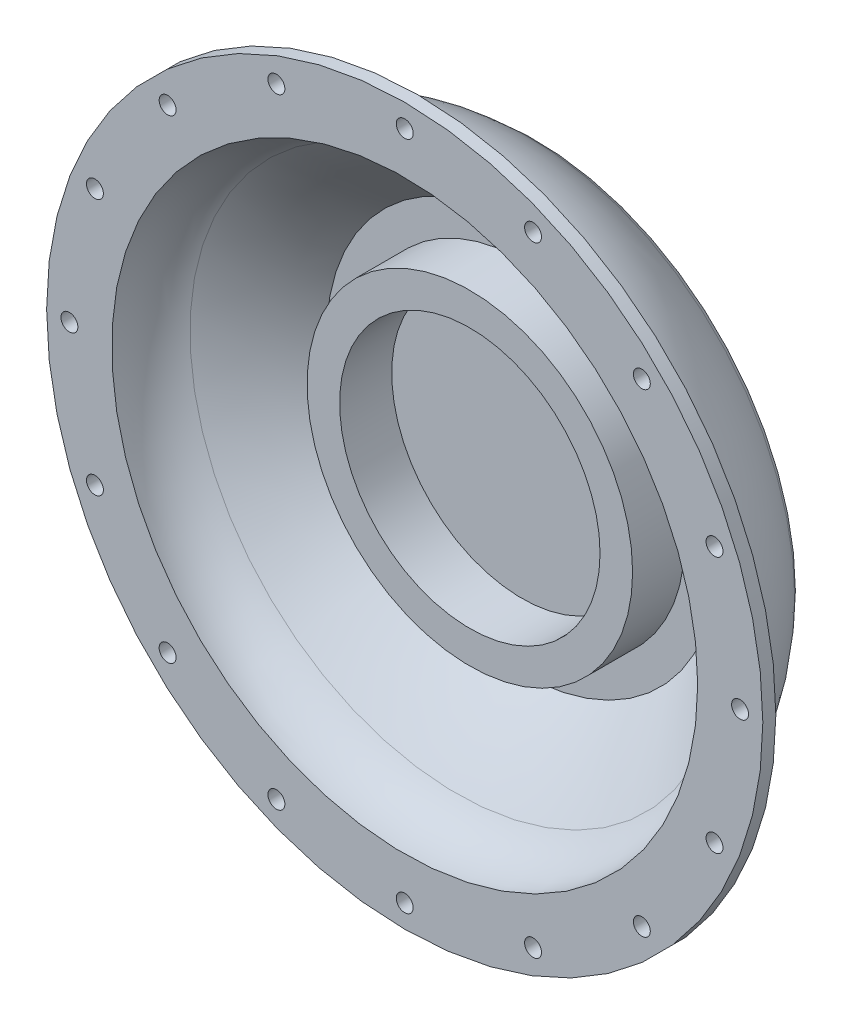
ISO-10303-21;
HEADER;
FILE_DESCRIPTION(('STEP AP214'),'2;1');
FILE_NAME('part.step','',(''),(''),'','','');
FILE_SCHEMA(('AUTOMOTIVE_DESIGN { 1 0 10303 214 1 1 1 1 }'));
ENDSEC;
DATA;
#1=APPLICATION_CONTEXT('core data for automotive mechanical design processes');
#2=APPLICATION_PROTOCOL_DEFINITION('international standard','automotive_design',2000,#1);
#3=PRODUCT_CONTEXT('',#1,'mechanical');
#4=PRODUCT('Part','Part','',(#3));
#5=PRODUCT_RELATED_PRODUCT_CATEGORY('part','',(#4));
#6=PRODUCT_DEFINITION_FORMATION('','',#4);
#7=PRODUCT_DEFINITION_CONTEXT('part definition',#1,'design');
#8=PRODUCT_DEFINITION('design','',#6,#7);
#9=PRODUCT_DEFINITION_SHAPE('','',#8);
#10=(LENGTH_UNIT() NAMED_UNIT(*) SI_UNIT(.MILLI.,.METRE.));
#11=(NAMED_UNIT(*) PLANE_ANGLE_UNIT() SI_UNIT($,.RADIAN.));
#12=(NAMED_UNIT(*) SI_UNIT($,.STERADIAN.) SOLID_ANGLE_UNIT());
#13=UNCERTAINTY_MEASURE_WITH_UNIT(LENGTH_MEASURE(1.E-05),#10,'distance_accuracy_value','');
#14=(GEOMETRIC_REPRESENTATION_CONTEXT(3) GLOBAL_UNCERTAINTY_ASSIGNED_CONTEXT((#13)) GLOBAL_UNIT_ASSIGNED_CONTEXT((#10,
#11,#12)) REPRESENTATION_CONTEXT('',''));
#15=CARTESIAN_POINT('',(0.,0.,0.));
#16=DIRECTION('',(0.,0.,1.));
#17=DIRECTION('',(1.,0.,0.));
#18=AXIS2_PLACEMENT_3D('',#15,#16,#17);
#19=CARTESIAN_POINT('',(0.,47.5610145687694,-2.));
#20=DIRECTION('',(0.,0.,1.));
#21=DIRECTION('',(1.,0.,0.));
#22=AXIS2_PLACEMENT_3D('',#19,#20,#21);
#23=PLANE('',#22);
#24=CARTESIAN_POINT('',(36.4159992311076,-36.4159992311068,-2.));
#25=DIRECTION('',(0.,0.,-1.));
#26=DIRECTION('',(-1.,0.,0.));
#27=AXIS2_PLACEMENT_3D('',#24,#25,#26);
#28=CIRCLE('',#27,1.3);
#29=CARTESIAN_POINT('',(35.1159992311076,-36.4159992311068,-2.));
#30=VERTEX_POINT('',#29);
#31=EDGE_CURVE('E164',#30,#30,#28,.T.);
#32=ORIENTED_EDGE('',*,*,#31,.F.);
#33=EDGE_LOOP('',(#32));
#34=FACE_BOUND('',#33,.T.);
#35=CARTESIAN_POINT('',(5.39433866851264E-13,-51.5,-2.));
#36=DIRECTION('',(0.,0.,-1.));
#37=DIRECTION('',(-1.,0.,0.));
#38=AXIS2_PLACEMENT_3D('',#35,#36,#37);
#39=CIRCLE('',#38,1.3);
#40=CARTESIAN_POINT('',(-1.29999999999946,-51.5,-2.));
#41=VERTEX_POINT('',#40);
#42=EDGE_CURVE('E152',#41,#41,#39,.T.);
#43=ORIENTED_EDGE('',*,*,#42,.F.);
#44=EDGE_LOOP('',(#43));
#45=FACE_BOUND('',#44,.T.);
#46=CARTESIAN_POINT('',(-36.4159992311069,-36.4159992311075,-2.));
#47=DIRECTION('',(0.,0.,-1.));
#48=DIRECTION('',(-1.,0.,0.));
#49=AXIS2_PLACEMENT_3D('',#46,#47,#48);
#50=CIRCLE('',#49,1.3);
#51=CARTESIAN_POINT('',(-37.7159992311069,-36.4159992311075,-2.));
#52=VERTEX_POINT('',#51);
#53=EDGE_CURVE('E140',#52,#52,#50,.T.);
#54=ORIENTED_EDGE('',*,*,#53,.F.);
#55=EDGE_LOOP('',(#54));
#56=FACE_BOUND('',#55,.T.);
#57=CARTESIAN_POINT('',(-47.5797959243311,-19.7081967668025,-2.));
#58=DIRECTION('',(0.,0.,-1.));
#59=DIRECTION('',(-1.,0.,0.));
#60=AXIS2_PLACEMENT_3D('',#57,#58,#59);
#61=CIRCLE('',#60,1.3);
#62=CARTESIAN_POINT('',(-48.8797959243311,-19.7081967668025,-2.));
#63=VERTEX_POINT('',#62);
#64=EDGE_CURVE('E134',#63,#63,#61,.T.);
#65=ORIENTED_EDGE('',*,*,#64,.F.);
#66=EDGE_LOOP('',(#65));
#67=FACE_BOUND('',#66,.T.);
#68=CARTESIAN_POINT('',(-51.5,0.,-2.));
#69=DIRECTION('',(0.,0.,-1.));
#70=DIRECTION('',(-1.,0.,0.));
#71=AXIS2_PLACEMENT_3D('',#68,#69,#70);
#72=CIRCLE('',#71,1.3);
#73=CARTESIAN_POINT('',(-52.8,0.,-2.));
#74=VERTEX_POINT('',#73);
#75=EDGE_CURVE('E128',#74,#74,#72,.T.);
#76=ORIENTED_EDGE('',*,*,#75,.F.);
#77=EDGE_LOOP('',(#76));
#78=FACE_BOUND('',#77,.T.);
#79=CARTESIAN_POINT('',(-36.4159992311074,36.415999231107,-2.));
#80=DIRECTION('',(0.,0.,-1.));
#81=DIRECTION('',(-1.,0.,0.));
#82=AXIS2_PLACEMENT_3D('',#79,#80,#81);
#83=CIRCLE('',#82,1.3);
#84=CARTESIAN_POINT('',(-37.7159992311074,36.415999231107,-2.));
#85=VERTEX_POINT('',#84);
#86=EDGE_CURVE('E116',#85,#85,#83,.T.);
#87=ORIENTED_EDGE('',*,*,#86,.F.);
#88=EDGE_LOOP('',(#87));
#89=FACE_BOUND('',#88,.T.);
#90=CARTESIAN_POINT('',(-19.7081967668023,47.5797959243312,-2.));
#91=DIRECTION('',(0.,0.,-1.));
#92=DIRECTION('',(-1.,0.,0.));
#93=AXIS2_PLACEMENT_3D('',#90,#91,#92);
#94=CIRCLE('',#93,1.3);
#95=CARTESIAN_POINT('',(-21.0081967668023,47.5797959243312,-2.));
#96=VERTEX_POINT('',#95);
#97=EDGE_CURVE('E110',#96,#96,#94,.T.);
#98=ORIENTED_EDGE('',*,*,#97,.F.);
#99=EDGE_LOOP('',(#98));
#100=FACE_BOUND('',#99,.T.);
#101=CARTESIAN_POINT('',(-1.79811288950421E-13,51.5,-2.));
#102=DIRECTION('',(0.,0.,-1.));
#103=DIRECTION('',(-1.,0.,0.));
#104=AXIS2_PLACEMENT_3D('',#101,#102,#103);
#105=CIRCLE('',#104,1.3);
#106=CARTESIAN_POINT('',(-1.30000000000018,51.5,-2.));
#107=VERTEX_POINT('',#106);
#108=EDGE_CURVE('E104',#107,#107,#105,.T.);
#109=ORIENTED_EDGE('',*,*,#108,.F.);
#110=EDGE_LOOP('',(#109));
#111=FACE_BOUND('',#110,.T.);
#112=CARTESIAN_POINT('',(19.708196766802,47.5797959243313,-2.));
#113=DIRECTION('',(0.,0.,-1.));
#114=DIRECTION('',(-1.,0.,0.));
#115=AXIS2_PLACEMENT_3D('',#112,#113,#114);
#116=CIRCLE('',#115,1.3);
#117=CARTESIAN_POINT('',(18.408196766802,47.5797959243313,-2.));
#118=VERTEX_POINT('',#117);
#119=EDGE_CURVE('E98',#118,#118,#116,.T.);
#120=ORIENTED_EDGE('',*,*,#119,.F.);
#121=EDGE_LOOP('',(#120));
#122=FACE_BOUND('',#121,.T.);
#123=CARTESIAN_POINT('',(36.4159992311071,36.4159992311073,-2.));
#124=DIRECTION('',(0.,0.,-1.));
#125=DIRECTION('',(-1.,0.,0.));
#126=AXIS2_PLACEMENT_3D('',#123,#124,#125);
#127=CIRCLE('',#126,1.3);
#128=CARTESIAN_POINT('',(35.1159992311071,36.4159992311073,-2.));
#129=VERTEX_POINT('',#128);
#130=EDGE_CURVE('E92',#129,#129,#127,.T.);
#131=ORIENTED_EDGE('',*,*,#130,.F.);
#132=EDGE_LOOP('',(#131));
#133=FACE_BOUND('',#132,.T.);
#134=CARTESIAN_POINT('',(47.5797959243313,19.7081967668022,-2.));
#135=DIRECTION('',(0.,0.,-1.));
#136=DIRECTION('',(-1.,0.,0.));
#137=AXIS2_PLACEMENT_3D('',#134,#135,#136);
#138=CIRCLE('',#137,1.3);
#139=CARTESIAN_POINT('',(46.2797959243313,19.7081967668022,-2.));
#140=VERTEX_POINT('',#139);
#141=EDGE_CURVE('E86',#140,#140,#138,.T.);
#142=ORIENTED_EDGE('',*,*,#141,.F.);
#143=EDGE_LOOP('',(#142));
#144=FACE_BOUND('',#143,.T.);
#145=CARTESIAN_POINT('',(51.5,0.,-2.));
#146=DIRECTION('',(0.,0.,-1.));
#147=DIRECTION('',(-1.,0.,0.));
#148=AXIS2_PLACEMENT_3D('',#145,#146,#147);
#149=CIRCLE('',#148,1.3);
#150=CARTESIAN_POINT('',(50.2,0.,-2.));
#151=VERTEX_POINT('',#150);
#152=EDGE_CURVE('E80',#151,#151,#149,.T.);
#153=ORIENTED_EDGE('',*,*,#152,.F.);
#154=EDGE_LOOP('',(#153));
#155=FACE_BOUND('',#154,.T.);
#156=CARTESIAN_POINT('',(0.,0.,-2.));
#157=DIRECTION('',(0.,0.,1.));
#158=DIRECTION('',(1.,0.,0.));
#159=AXIS2_PLACEMENT_3D('',#156,#157,#158);
#160=CIRCLE('',#159,55.);
#161=CARTESIAN_POINT('',(55.,0.,-2.));
#162=VERTEX_POINT('',#161);
#163=EDGE_CURVE('E44',#162,#162,#160,.T.);
#164=ORIENTED_EDGE('',*,*,#163,.F.);
#165=EDGE_LOOP('',(#164));
#166=FACE_BOUND('',#165,.T.);
#167=CARTESIAN_POINT('',(0.,0.,-2.));
#168=DIRECTION('',(0.,0.,1.));
#169=DIRECTION('',(1.,0.,0.));
#170=AXIS2_PLACEMENT_3D('',#167,#168,#169);
#171=CIRCLE('',#170,47.5610145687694);
#172=CARTESIAN_POINT('',(47.5610145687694,0.,-2.));
#173=VERTEX_POINT('',#172);
#174=EDGE_CURVE('E48',#173,#173,#171,.T.);
#175=ORIENTED_EDGE('',*,*,#174,.T.);
#176=EDGE_LOOP('',(#175));
#177=FACE_BOUND('',#176,.T.);
#178=CARTESIAN_POINT('',(-47.5797959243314,19.7081967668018,-2.));
#179=DIRECTION('',(0.,0.,-1.));
#180=DIRECTION('',(-1.,0.,0.));
#181=AXIS2_PLACEMENT_3D('',#178,#179,#180);
#182=CIRCLE('',#181,1.3);
#183=CARTESIAN_POINT('',(-48.8797959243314,19.7081967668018,-2.));
#184=VERTEX_POINT('',#183);
#185=EDGE_CURVE('E122',#184,#184,#182,.T.);
#186=ORIENTED_EDGE('',*,*,#185,.F.);
#187=EDGE_LOOP('',(#186));
#188=FACE_BOUND('',#187,.T.);
#189=CARTESIAN_POINT('',(-19.7081967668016,-47.5797959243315,-2.));
#190=DIRECTION('',(0.,0.,-1.));
#191=DIRECTION('',(-1.,0.,0.));
#192=AXIS2_PLACEMENT_3D('',#189,#190,#191);
#193=CIRCLE('',#192,1.3);
#194=CARTESIAN_POINT('',(-21.0081967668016,-47.5797959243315,-2.));
#195=VERTEX_POINT('',#194);
#196=EDGE_CURVE('E146',#195,#195,#193,.T.);
#197=ORIENTED_EDGE('',*,*,#196,.F.);
#198=EDGE_LOOP('',(#197));
#199=FACE_BOUND('',#198,.T.);
#200=CARTESIAN_POINT('',(19.7081967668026,-47.5797959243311,-2.));
#201=DIRECTION('',(0.,0.,-1.));
#202=DIRECTION('',(-1.,0.,0.));
#203=AXIS2_PLACEMENT_3D('',#200,#201,#202);
#204=CIRCLE('',#203,1.3);
#205=CARTESIAN_POINT('',(18.4081967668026,-47.5797959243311,-2.));
#206=VERTEX_POINT('',#205);
#207=EDGE_CURVE('E158',#206,#206,#204,.T.);
#208=ORIENTED_EDGE('',*,*,#207,.F.);
#209=EDGE_LOOP('',(#208));
#210=FACE_BOUND('',#209,.T.);
#211=CARTESIAN_POINT('',(47.5797959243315,-19.7081967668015,-2.));
#212=DIRECTION('',(0.,0.,-1.));
#213=DIRECTION('',(-1.,0.,0.));
#214=AXIS2_PLACEMENT_3D('',#211,#212,#213);
#215=CIRCLE('',#214,1.3);
#216=CARTESIAN_POINT('',(46.2797959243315,-19.7081967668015,-2.));
#217=VERTEX_POINT('',#216);
#218=EDGE_CURVE('E170',#217,#217,#215,.T.);
#219=ORIENTED_EDGE('',*,*,#218,.F.);
#220=EDGE_LOOP('',(#219));
#221=FACE_BOUND('',#220,.T.);
#222=ADVANCED_FACE('F33',(#34,#45,#56,#67,#78,#89,#100,#111,#122,#133,#144,#155,#166,#177,#188,
#199,#210,#221),#23,.F.);
#223=CARTESIAN_POINT('',(0.,0.,0.));
#224=DIRECTION('',(0.,0.,1.));
#225=DIRECTION('',(1.,0.,0.));
#226=AXIS2_PLACEMENT_3D('',#223,#224,#225);
#227=TOROIDAL_SURFACE('',#226,35.,9.99999999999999);
#228=CARTESIAN_POINT('',(0.,0.,-8.00598725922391));
#229=DIRECTION('',(0.,0.,1.));
#230=DIRECTION('',(1.,0.,0.));
#231=AXIS2_PLACEMENT_3D('',#228,#229,#230);
#232=CIRCLE('',#231,40.9920086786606);
#233=CARTESIAN_POINT('',(40.9920086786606,0.,-8.00598725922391));
#234=VERTEX_POINT('',#233);
#235=EDGE_CURVE('E74',#234,#234,#232,.T.);
#236=ORIENTED_EDGE('',*,*,#235,.F.);
#237=EDGE_LOOP('',(#236));
#238=FACE_BOUND('',#237,.T.);
#239=CARTESIAN_POINT('',(0.,0.,0.));
#240=DIRECTION('',(0.,0.,1.));
#241=DIRECTION('',(1.,0.,0.));
#242=AXIS2_PLACEMENT_3D('',#239,#240,#241);
#243=CIRCLE('',#242,45.);
#244=CARTESIAN_POINT('',(45.,0.,0.));
#245=VERTEX_POINT('',#244);
#246=EDGE_CURVE('E10',#245,#245,#243,.T.);
#247=ORIENTED_EDGE('',*,*,#246,.T.);
#248=EDGE_LOOP('',(#247));
#249=FACE_BOUND('',#248,.T.);
#250=ADVANCED_FACE('F35',(#238,#249),#227,.F.);
#251=CARTESIAN_POINT('',(0.,55.,0.));
#252=DIRECTION('',(0.,0.,-1.));
#253=DIRECTION('',(-1.,0.,0.));
#254=AXIS2_PLACEMENT_3D('',#251,#252,#253);
#255=PLANE('',#254);
#256=CARTESIAN_POINT('',(47.5797959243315,-19.7081967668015,0.));
#257=DIRECTION('',(0.,0.,-1.));
#258=DIRECTION('',(-1.,0.,0.));
#259=AXIS2_PLACEMENT_3D('',#256,#257,#258);
#260=CIRCLE('',#259,1.3);
#261=CARTESIAN_POINT('',(46.2797959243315,-19.7081967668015,0.));
#262=VERTEX_POINT('',#261);
#263=EDGE_CURVE('E167',#262,#262,#260,.T.);
#264=ORIENTED_EDGE('',*,*,#263,.T.);
#265=EDGE_LOOP('',(#264));
#266=FACE_BOUND('',#265,.T.);
#267=CARTESIAN_POINT('',(36.4159992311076,-36.4159992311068,0.));
#268=DIRECTION('',(0.,0.,-1.));
#269=DIRECTION('',(-1.,0.,0.));
#270=AXIS2_PLACEMENT_3D('',#267,#268,#269);
#271=CIRCLE('',#270,1.3);
#272=CARTESIAN_POINT('',(35.1159992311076,-36.4159992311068,0.));
#273=VERTEX_POINT('',#272);
#274=EDGE_CURVE('E161',#273,#273,#271,.T.);
#275=ORIENTED_EDGE('',*,*,#274,.T.);
#276=EDGE_LOOP('',(#275));
#277=FACE_BOUND('',#276,.T.);
#278=CARTESIAN_POINT('',(19.7081967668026,-47.5797959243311,0.));
#279=DIRECTION('',(0.,0.,-1.));
#280=DIRECTION('',(-1.,0.,0.));
#281=AXIS2_PLACEMENT_3D('',#278,#279,#280);
#282=CIRCLE('',#281,1.3);
#283=CARTESIAN_POINT('',(18.4081967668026,-47.5797959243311,0.));
#284=VERTEX_POINT('',#283);
#285=EDGE_CURVE('E155',#284,#284,#282,.T.);
#286=ORIENTED_EDGE('',*,*,#285,.T.);
#287=EDGE_LOOP('',(#286));
#288=FACE_BOUND('',#287,.T.);
#289=CARTESIAN_POINT('',(5.39433866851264E-13,-51.5,0.));
#290=DIRECTION('',(0.,0.,-1.));
#291=DIRECTION('',(-1.,0.,0.));
#292=AXIS2_PLACEMENT_3D('',#289,#290,#291);
#293=CIRCLE('',#292,1.3);
#294=CARTESIAN_POINT('',(-1.29999999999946,-51.5,0.));
#295=VERTEX_POINT('',#294);
#296=EDGE_CURVE('E149',#295,#295,#293,.T.);
#297=ORIENTED_EDGE('',*,*,#296,.T.);
#298=EDGE_LOOP('',(#297));
#299=FACE_BOUND('',#298,.T.);
#300=CARTESIAN_POINT('',(-19.7081967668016,-47.5797959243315,0.));
#301=DIRECTION('',(0.,0.,-1.));
#302=DIRECTION('',(-1.,0.,0.));
#303=AXIS2_PLACEMENT_3D('',#300,#301,#302);
#304=CIRCLE('',#303,1.3);
#305=CARTESIAN_POINT('',(-21.0081967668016,-47.5797959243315,0.));
#306=VERTEX_POINT('',#305);
#307=EDGE_CURVE('E143',#306,#306,#304,.T.);
#308=ORIENTED_EDGE('',*,*,#307,.T.);
#309=EDGE_LOOP('',(#308));
#310=FACE_BOUND('',#309,.T.);
#311=CARTESIAN_POINT('',(-36.4159992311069,-36.4159992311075,0.));
#312=DIRECTION('',(0.,0.,-1.));
#313=DIRECTION('',(-1.,0.,0.));
#314=AXIS2_PLACEMENT_3D('',#311,#312,#313);
#315=CIRCLE('',#314,1.3);
#316=CARTESIAN_POINT('',(-37.7159992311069,-36.4159992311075,0.));
#317=VERTEX_POINT('',#316);
#318=EDGE_CURVE('E137',#317,#317,#315,.T.);
#319=ORIENTED_EDGE('',*,*,#318,.T.);
#320=EDGE_LOOP('',(#319));
#321=FACE_BOUND('',#320,.T.);
#322=CARTESIAN_POINT('',(-47.5797959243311,-19.7081967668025,0.));
#323=DIRECTION('',(0.,0.,-1.));
#324=DIRECTION('',(-1.,0.,0.));
#325=AXIS2_PLACEMENT_3D('',#322,#323,#324);
#326=CIRCLE('',#325,1.3);
#327=CARTESIAN_POINT('',(-48.8797959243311,-19.7081967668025,0.));
#328=VERTEX_POINT('',#327);
#329=EDGE_CURVE('E131',#328,#328,#326,.T.);
#330=ORIENTED_EDGE('',*,*,#329,.T.);
#331=EDGE_LOOP('',(#330));
#332=FACE_BOUND('',#331,.T.);
#333=CARTESIAN_POINT('',(-51.5,0.,0.));
#334=DIRECTION('',(0.,0.,-1.));
#335=DIRECTION('',(-1.,0.,0.));
#336=AXIS2_PLACEMENT_3D('',#333,#334,#335);
#337=CIRCLE('',#336,1.3);
#338=CARTESIAN_POINT('',(-52.8,0.,0.));
#339=VERTEX_POINT('',#338);
#340=EDGE_CURVE('E125',#339,#339,#337,.T.);
#341=ORIENTED_EDGE('',*,*,#340,.T.);
#342=EDGE_LOOP('',(#341));
#343=FACE_BOUND('',#342,.T.);
#344=CARTESIAN_POINT('',(-47.5797959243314,19.7081967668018,0.));
#345=DIRECTION('',(0.,0.,-1.));
#346=DIRECTION('',(-1.,0.,0.));
#347=AXIS2_PLACEMENT_3D('',#344,#345,#346);
#348=CIRCLE('',#347,1.3);
#349=CARTESIAN_POINT('',(-48.8797959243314,19.7081967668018,0.));
#350=VERTEX_POINT('',#349);
#351=EDGE_CURVE('E119',#350,#350,#348,.T.);
#352=ORIENTED_EDGE('',*,*,#351,.T.);
#353=EDGE_LOOP('',(#352));
#354=FACE_BOUND('',#353,.T.);
#355=CARTESIAN_POINT('',(-36.4159992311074,36.415999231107,0.));
#356=DIRECTION('',(0.,0.,-1.));
#357=DIRECTION('',(-1.,0.,0.));
#358=AXIS2_PLACEMENT_3D('',#355,#356,#357);
#359=CIRCLE('',#358,1.3);
#360=CARTESIAN_POINT('',(-37.7159992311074,36.415999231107,0.));
#361=VERTEX_POINT('',#360);
#362=EDGE_CURVE('E113',#361,#361,#359,.T.);
#363=ORIENTED_EDGE('',*,*,#362,.T.);
#364=EDGE_LOOP('',(#363));
#365=FACE_BOUND('',#364,.T.);
#366=CARTESIAN_POINT('',(-19.7081967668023,47.5797959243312,0.));
#367=DIRECTION('',(0.,0.,-1.));
#368=DIRECTION('',(-1.,0.,0.));
#369=AXIS2_PLACEMENT_3D('',#366,#367,#368);
#370=CIRCLE('',#369,1.3);
#371=CARTESIAN_POINT('',(-21.0081967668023,47.5797959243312,0.));
#372=VERTEX_POINT('',#371);
#373=EDGE_CURVE('E107',#372,#372,#370,.T.);
#374=ORIENTED_EDGE('',*,*,#373,.T.);
#375=EDGE_LOOP('',(#374));
#376=FACE_BOUND('',#375,.T.);
#377=CARTESIAN_POINT('',(-1.79811288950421E-13,51.5,0.));
#378=DIRECTION('',(0.,0.,-1.));
#379=DIRECTION('',(-1.,0.,0.));
#380=AXIS2_PLACEMENT_3D('',#377,#378,#379);
#381=CIRCLE('',#380,1.3);
#382=CARTESIAN_POINT('',(-1.30000000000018,51.5,0.));
#383=VERTEX_POINT('',#382);
#384=EDGE_CURVE('E101',#383,#383,#381,.T.);
#385=ORIENTED_EDGE('',*,*,#384,.T.);
#386=EDGE_LOOP('',(#385));
#387=FACE_BOUND('',#386,.T.);
#388=CARTESIAN_POINT('',(19.708196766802,47.5797959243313,0.));
#389=DIRECTION('',(0.,0.,-1.));
#390=DIRECTION('',(-1.,0.,0.));
#391=AXIS2_PLACEMENT_3D('',#388,#389,#390);
#392=CIRCLE('',#391,1.3);
#393=CARTESIAN_POINT('',(18.408196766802,47.5797959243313,0.));
#394=VERTEX_POINT('',#393);
#395=EDGE_CURVE('E95',#394,#394,#392,.T.);
#396=ORIENTED_EDGE('',*,*,#395,.T.);
#397=EDGE_LOOP('',(#396));
#398=FACE_BOUND('',#397,.T.);
#399=CARTESIAN_POINT('',(36.4159992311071,36.4159992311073,0.));
#400=DIRECTION('',(0.,0.,-1.));
#401=DIRECTION('',(-1.,0.,0.));
#402=AXIS2_PLACEMENT_3D('',#399,#400,#401);
#403=CIRCLE('',#402,1.3);
#404=CARTESIAN_POINT('',(35.1159992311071,36.4159992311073,0.));
#405=VERTEX_POINT('',#404);
#406=EDGE_CURVE('E89',#405,#405,#403,.T.);
#407=ORIENTED_EDGE('',*,*,#406,.T.);
#408=EDGE_LOOP('',(#407));
#409=FACE_BOUND('',#408,.T.);
#410=CARTESIAN_POINT('',(47.5797959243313,19.7081967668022,0.));
#411=DIRECTION('',(0.,0.,-1.));
#412=DIRECTION('',(-1.,0.,0.));
#413=AXIS2_PLACEMENT_3D('',#410,#411,#412);
#414=CIRCLE('',#413,1.3);
#415=CARTESIAN_POINT('',(46.2797959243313,19.7081967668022,0.));
#416=VERTEX_POINT('',#415);
#417=EDGE_CURVE('E83',#416,#416,#414,.T.);
#418=ORIENTED_EDGE('',*,*,#417,.T.);
#419=EDGE_LOOP('',(#418));
#420=FACE_BOUND('',#419,.T.);
#421=CARTESIAN_POINT('',(51.5,0.,0.));
#422=DIRECTION('',(0.,0.,-1.));
#423=DIRECTION('',(-1.,0.,0.));
#424=AXIS2_PLACEMENT_3D('',#421,#422,#423);
#425=CIRCLE('',#424,1.3);
#426=CARTESIAN_POINT('',(50.2,0.,0.));
#427=VERTEX_POINT('',#426);
#428=EDGE_CURVE('E77',#427,#427,#425,.T.);
#429=ORIENTED_EDGE('',*,*,#428,.T.);
#430=EDGE_LOOP('',(#429));
#431=FACE_BOUND('',#430,.T.);
#432=ORIENTED_EDGE('',*,*,#246,.F.);
#433=EDGE_LOOP('',(#432));
#434=FACE_BOUND('',#433,.T.);
#435=CARTESIAN_POINT('',(0.,0.,0.));
#436=DIRECTION('',(0.,0.,1.));
#437=DIRECTION('',(1.,0.,0.));
#438=AXIS2_PLACEMENT_3D('',#435,#436,#437);
#439=CIRCLE('',#438,55.);
#440=CARTESIAN_POINT('',(55.,0.,0.));
#441=VERTEX_POINT('',#440);
#442=EDGE_CURVE('E40',#441,#441,#439,.T.);
#443=ORIENTED_EDGE('',*,*,#442,.T.);
#444=EDGE_LOOP('',(#443));
#445=FACE_BOUND('',#444,.T.);
#446=ADVANCED_FACE('F182',(#266,#277,#288,#299,#310,#321,#332,#343,#354,#365,#376,#387,#398,
#409,#420,#431,#434,#445),#255,.F.);
#447=CARTESIAN_POINT('',(0.,0.,0.));
#448=DIRECTION('',(0.,0.,1.));
#449=DIRECTION('',(1.,0.,0.));
#450=AXIS2_PLACEMENT_3D('',#447,#448,#449);
#451=CYLINDRICAL_SURFACE('',#450,55.);
#452=ORIENTED_EDGE('',*,*,#442,.F.);
#453=EDGE_LOOP('',(#452));
#454=FACE_BOUND('',#453,.T.);
#455=ORIENTED_EDGE('',*,*,#163,.T.);
#456=EDGE_LOOP('',(#455));
#457=FACE_BOUND('',#456,.T.);
#458=ADVANCED_FACE('F190',(#454,#457),#451,.T.);
#459=CARTESIAN_POINT('',(0.,0.,-2.));
#460=DIRECTION('',(0.,0.,1.));
#461=DIRECTION('',(1.,0.,0.));
#462=AXIS2_PLACEMENT_3D('',#459,#460,#461);
#463=DEGENERATE_TOROIDAL_SURFACE('',#462,22.5610145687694,25.,.T.);
#464=ORIENTED_EDGE('',*,*,#174,.F.);
#465=EDGE_LOOP('',(#464));
#466=FACE_BOUND('',#465,.T.);
#467=CARTESIAN_POINT('',(0.,0.,-19.1187053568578));
#468=DIRECTION('',(0.,0.,1.));
#469=DIRECTION('',(1.,0.,0.));
#470=AXIS2_PLACEMENT_3D('',#467,#468,#469);
#471=CIRCLE('',#470,40.7805076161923);
#472=CARTESIAN_POINT('',(40.7805076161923,0.,-19.1187053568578));
#473=VERTEX_POINT('',#472);
#474=EDGE_CURVE('E53',#473,#473,#471,.T.);
#475=ORIENTED_EDGE('',*,*,#474,.T.);
#476=EDGE_LOOP('',(#475));
#477=FACE_BOUND('',#476,.T.);
#478=ADVANCED_FACE('F188',(#466,#477),#463,.T.);
#479=CARTESIAN_POINT('',(0.,0.,-32.813669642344));
#480=DIRECTION('',(0.,0.,1.));
#481=DIRECTION('',(1.,0.,0.));
#482=AXIS2_PLACEMENT_3D('',#479,#480,#481);
#483=TOROIDAL_SURFACE('',#482,55.3561020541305,20.);
#484=ORIENTED_EDGE('',*,*,#474,.F.);
#485=EDGE_LOOP('',(#484));
#486=FACE_BOUND('',#485,.T.);
#487=CARTESIAN_POINT('',(0.,0.,-20.));
#488=DIRECTION('',(0.,0.,1.));
#489=DIRECTION('',(1.,0.,0.));
#490=AXIS2_PLACEMENT_3D('',#487,#488,#489);
#491=CIRCLE('',#490,40.);
#492=CARTESIAN_POINT('',(40.,0.,-20.));
#493=VERTEX_POINT('',#492);
#494=EDGE_CURVE('E56',#493,#493,#491,.T.);
#495=ORIENTED_EDGE('',*,*,#494,.T.);
#496=EDGE_LOOP('',(#495));
#497=FACE_BOUND('',#496,.T.);
#498=ADVANCED_FACE('F333',(#486,#497),#483,.F.);
#499=CARTESIAN_POINT('',(0.,0.,-20.));
#500=DIRECTION('',(0.,0.,1.));
#501=DIRECTION('',(1.,0.,0.));
#502=AXIS2_PLACEMENT_3D('',#499,#500,#501);
#503=PLANE('',#502);
#504=ORIENTED_EDGE('',*,*,#494,.F.);
#505=EDGE_LOOP('',(#504));
#506=FACE_BOUND('',#505,.T.);
#507=ADVANCED_FACE('F330',(#506),#503,.F.);
#508=CARTESIAN_POINT('',(0.,20.,-18.));
#509=DIRECTION('',(0.,0.,-1.));
#510=DIRECTION('',(-1.,0.,0.));
#511=AXIS2_PLACEMENT_3D('',#508,#509,#510);
#512=PLANE('',#511);
#513=CARTESIAN_POINT('',(0.,0.,-18.));
#514=DIRECTION('',(0.,0.,1.));
#515=DIRECTION('',(1.,0.,0.));
#516=AXIS2_PLACEMENT_3D('',#513,#514,#515);
#517=CIRCLE('',#516,20.);
#518=CARTESIAN_POINT('',(20.,0.,-18.));
#519=VERTEX_POINT('',#518);
#520=EDGE_CURVE('E59',#519,#519,#517,.T.);
#521=ORIENTED_EDGE('',*,*,#520,.T.);
#522=EDGE_LOOP('',(#521));
#523=FACE_BOUND('',#522,.T.);
#524=ADVANCED_FACE('F326',(#523),#512,.F.);
#525=CARTESIAN_POINT('',(0.,0.,0.));
#526=DIRECTION('',(0.,0.,1.));
#527=DIRECTION('',(1.,0.,0.));
#528=AXIS2_PLACEMENT_3D('',#525,#526,#527);
#529=CYLINDRICAL_SURFACE('',#528,20.);
#530=ORIENTED_EDGE('',*,*,#520,.F.);
#531=EDGE_LOOP('',(#530));
#532=FACE_BOUND('',#531,.T.);
#533=CARTESIAN_POINT('',(0.,0.,-10.));
#534=DIRECTION('',(0.,0.,1.));
#535=DIRECTION('',(1.,0.,0.));
#536=AXIS2_PLACEMENT_3D('',#533,#534,#535);
#537=CIRCLE('',#536,20.);
#538=CARTESIAN_POINT('',(20.,0.,-10.));
#539=VERTEX_POINT('',#538);
#540=EDGE_CURVE('E62',#539,#539,#537,.T.);
#541=ORIENTED_EDGE('',*,*,#540,.T.);
#542=EDGE_LOOP('',(#541));
#543=FACE_BOUND('',#542,.T.);
#544=ADVANCED_FACE('F322',(#532,#543),#529,.F.);
#545=CARTESIAN_POINT('',(0.,25.,-10.));
#546=DIRECTION('',(0.,0.,-1.));
#547=DIRECTION('',(-1.,0.,0.));
#548=AXIS2_PLACEMENT_3D('',#545,#546,#547);
#549=PLANE('',#548);
#550=ORIENTED_EDGE('',*,*,#540,.F.);
#551=EDGE_LOOP('',(#550));
#552=FACE_BOUND('',#551,.T.);
#553=CARTESIAN_POINT('',(0.,0.,-10.));
#554=DIRECTION('',(0.,0.,1.));
#555=DIRECTION('',(1.,0.,0.));
#556=AXIS2_PLACEMENT_3D('',#553,#554,#555);
#557=CIRCLE('',#556,25.);
#558=CARTESIAN_POINT('',(25.,0.,-10.));
#559=VERTEX_POINT('',#558);
#560=EDGE_CURVE('E65',#559,#559,#557,.T.);
#561=ORIENTED_EDGE('',*,*,#560,.T.);
#562=EDGE_LOOP('',(#561));
#563=FACE_BOUND('',#562,.T.);
#564=ADVANCED_FACE('F318',(#552,#563),#549,.F.);
#565=CARTESIAN_POINT('',(0.,0.,0.));
#566=DIRECTION('',(0.,0.,1.));
#567=DIRECTION('',(1.,0.,0.));
#568=AXIS2_PLACEMENT_3D('',#565,#566,#567);
#569=CYLINDRICAL_SURFACE('',#568,25.);
#570=ORIENTED_EDGE('',*,*,#560,.F.);
#571=EDGE_LOOP('',(#570));
#572=FACE_BOUND('',#571,.T.);
#573=CARTESIAN_POINT('',(0.,0.,-18.));
#574=DIRECTION('',(0.,0.,1.));
#575=DIRECTION('',(1.,0.,0.));
#576=AXIS2_PLACEMENT_3D('',#573,#574,#575);
#577=CIRCLE('',#576,25.);
#578=CARTESIAN_POINT('',(25.,0.,-18.));
#579=VERTEX_POINT('',#578);
#580=EDGE_CURVE('E68',#579,#579,#577,.T.);
#581=ORIENTED_EDGE('',*,*,#580,.T.);
#582=EDGE_LOOP('',(#581));
#583=FACE_BOUND('',#582,.T.);
#584=ADVANCED_FACE('F314',(#572,#583),#569,.T.);
#585=CARTESIAN_POINT('',(0.,25.,-18.));
#586=DIRECTION('',(0.,0.,-1.));
#587=DIRECTION('',(-1.,0.,0.));
#588=AXIS2_PLACEMENT_3D('',#585,#586,#587);
#589=PLANE('',#588);
#590=ORIENTED_EDGE('',*,*,#580,.F.);
#591=EDGE_LOOP('',(#590));
#592=FACE_BOUND('',#591,.T.);
#593=CARTESIAN_POINT('',(0.,0.,-18.));
#594=DIRECTION('',(0.,0.,1.));
#595=DIRECTION('',(1.,0.,0.));
#596=AXIS2_PLACEMENT_3D('',#593,#594,#595);
#597=CIRCLE('',#596,30.);
#598=CARTESIAN_POINT('',(30.,0.,-18.));
#599=VERTEX_POINT('',#598);
#600=EDGE_CURVE('E71',#599,#599,#597,.T.);
#601=ORIENTED_EDGE('',*,*,#600,.T.);
#602=EDGE_LOOP('',(#601));
#603=FACE_BOUND('',#602,.T.);
#604=ADVANCED_FACE('F310',(#592,#603),#589,.F.);
#605=CARTESIAN_POINT('',(0.,0.,-70.4526878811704));
#606=DIRECTION('',(0.,0.,1.));
#607=DIRECTION('',(1.,0.,0.));
#608=AXIS2_PLACEMENT_3D('',#605,#606,#607);
#609=TOROIDAL_SURFACE('',#608,87.7296763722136,78.);
#610=ORIENTED_EDGE('',*,*,#600,.F.);
#611=EDGE_LOOP('',(#610));
#612=FACE_BOUND('',#611,.T.);
#613=ORIENTED_EDGE('',*,*,#235,.T.);
#614=EDGE_LOOP('',(#613));
#615=FACE_BOUND('',#614,.T.);
#616=ADVANCED_FACE('F234',(#612,#615),#609,.T.);
#617=CARTESIAN_POINT('',(51.5,0.,-2.));
#618=DIRECTION('',(0.,0.,-1.));
#619=DIRECTION('',(-1.,0.,0.));
#620=AXIS2_PLACEMENT_3D('',#617,#618,#619);
#621=CYLINDRICAL_SURFACE('',#620,1.3);
#622=ORIENTED_EDGE('',*,*,#428,.F.);
#623=EDGE_LOOP('',(#622));
#624=FACE_BOUND('',#623,.T.);
#625=ORIENTED_EDGE('',*,*,#152,.T.);
#626=EDGE_LOOP('',(#625));
#627=FACE_BOUND('',#626,.T.);
#628=ADVANCED_FACE('F230',(#624,#627),#621,.F.);
#629=CARTESIAN_POINT('',(47.5797959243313,19.7081967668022,-2.));
#630=DIRECTION('',(0.,0.,-1.));
#631=DIRECTION('',(-1.,0.,0.));
#632=AXIS2_PLACEMENT_3D('',#629,#630,#631);
#633=CYLINDRICAL_SURFACE('',#632,1.3);
#634=ORIENTED_EDGE('',*,*,#417,.F.);
#635=EDGE_LOOP('',(#634));
#636=FACE_BOUND('',#635,.T.);
#637=ORIENTED_EDGE('',*,*,#141,.T.);
#638=EDGE_LOOP('',(#637));
#639=FACE_BOUND('',#638,.T.);
#640=ADVANCED_FACE('F233',(#636,#639),#633,.F.);
#641=CARTESIAN_POINT('',(36.4159992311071,36.4159992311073,-2.));
#642=DIRECTION('',(0.,0.,-1.));
#643=DIRECTION('',(-1.,0.,0.));
#644=AXIS2_PLACEMENT_3D('',#641,#642,#643);
#645=CYLINDRICAL_SURFACE('',#644,1.3);
#646=ORIENTED_EDGE('',*,*,#406,.F.);
#647=EDGE_LOOP('',(#646));
#648=FACE_BOUND('',#647,.T.);
#649=ORIENTED_EDGE('',*,*,#130,.T.);
#650=EDGE_LOOP('',(#649));
#651=FACE_BOUND('',#650,.T.);
#652=ADVANCED_FACE('F300',(#648,#651),#645,.F.);
#653=CARTESIAN_POINT('',(19.708196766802,47.5797959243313,-2.));
#654=DIRECTION('',(0.,0.,-1.));
#655=DIRECTION('',(-1.,0.,0.));
#656=AXIS2_PLACEMENT_3D('',#653,#654,#655);
#657=CYLINDRICAL_SURFACE('',#656,1.3);
#658=ORIENTED_EDGE('',*,*,#395,.F.);
#659=EDGE_LOOP('',(#658));
#660=FACE_BOUND('',#659,.T.);
#661=ORIENTED_EDGE('',*,*,#119,.T.);
#662=EDGE_LOOP('',(#661));
#663=FACE_BOUND('',#662,.T.);
#664=ADVANCED_FACE('F296',(#660,#663),#657,.F.);
#665=CARTESIAN_POINT('',(-1.79811288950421E-13,51.5,-2.));
#666=DIRECTION('',(0.,0.,-1.));
#667=DIRECTION('',(-1.,0.,0.));
#668=AXIS2_PLACEMENT_3D('',#665,#666,#667);
#669=CYLINDRICAL_SURFACE('',#668,1.3);
#670=ORIENTED_EDGE('',*,*,#384,.F.);
#671=EDGE_LOOP('',(#670));
#672=FACE_BOUND('',#671,.T.);
#673=ORIENTED_EDGE('',*,*,#108,.T.);
#674=EDGE_LOOP('',(#673));
#675=FACE_BOUND('',#674,.T.);
#676=ADVANCED_FACE('F292',(#672,#675),#669,.F.);
#677=CARTESIAN_POINT('',(-19.7081967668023,47.5797959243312,-2.));
#678=DIRECTION('',(0.,0.,-1.));
#679=DIRECTION('',(-1.,0.,0.));
#680=AXIS2_PLACEMENT_3D('',#677,#678,#679);
#681=CYLINDRICAL_SURFACE('',#680,1.3);
#682=ORIENTED_EDGE('',*,*,#373,.F.);
#683=EDGE_LOOP('',(#682));
#684=FACE_BOUND('',#683,.T.);
#685=ORIENTED_EDGE('',*,*,#97,.T.);
#686=EDGE_LOOP('',(#685));
#687=FACE_BOUND('',#686,.T.);
#688=ADVANCED_FACE('F288',(#684,#687),#681,.F.);
#689=CARTESIAN_POINT('',(-36.4159992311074,36.415999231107,-2.));
#690=DIRECTION('',(0.,0.,-1.));
#691=DIRECTION('',(-1.,0.,0.));
#692=AXIS2_PLACEMENT_3D('',#689,#690,#691);
#693=CYLINDRICAL_SURFACE('',#692,1.3);
#694=ORIENTED_EDGE('',*,*,#362,.F.);
#695=EDGE_LOOP('',(#694));
#696=FACE_BOUND('',#695,.T.);
#697=ORIENTED_EDGE('',*,*,#86,.T.);
#698=EDGE_LOOP('',(#697));
#699=FACE_BOUND('',#698,.T.);
#700=ADVANCED_FACE('F284',(#696,#699),#693,.F.);
#701=CARTESIAN_POINT('',(-47.5797959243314,19.7081967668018,-2.));
#702=DIRECTION('',(0.,0.,-1.));
#703=DIRECTION('',(-1.,0.,0.));
#704=AXIS2_PLACEMENT_3D('',#701,#702,#703);
#705=CYLINDRICAL_SURFACE('',#704,1.3);
#706=ORIENTED_EDGE('',*,*,#351,.F.);
#707=EDGE_LOOP('',(#706));
#708=FACE_BOUND('',#707,.T.);
#709=ORIENTED_EDGE('',*,*,#185,.T.);
#710=EDGE_LOOP('',(#709));
#711=FACE_BOUND('',#710,.T.);
#712=ADVANCED_FACE('F280',(#708,#711),#705,.F.);
#713=CARTESIAN_POINT('',(-51.5,0.,-2.));
#714=DIRECTION('',(0.,0.,-1.));
#715=DIRECTION('',(-1.,0.,0.));
#716=AXIS2_PLACEMENT_3D('',#713,#714,#715);
#717=CYLINDRICAL_SURFACE('',#716,1.3);
#718=ORIENTED_EDGE('',*,*,#340,.F.);
#719=EDGE_LOOP('',(#718));
#720=FACE_BOUND('',#719,.T.);
#721=ORIENTED_EDGE('',*,*,#75,.T.);
#722=EDGE_LOOP('',(#721));
#723=FACE_BOUND('',#722,.T.);
#724=ADVANCED_FACE('F276',(#720,#723),#717,.F.);
#725=CARTESIAN_POINT('',(-47.5797959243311,-19.7081967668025,-2.));
#726=DIRECTION('',(0.,0.,-1.));
#727=DIRECTION('',(-1.,0.,0.));
#728=AXIS2_PLACEMENT_3D('',#725,#726,#727);
#729=CYLINDRICAL_SURFACE('',#728,1.3);
#730=ORIENTED_EDGE('',*,*,#329,.F.);
#731=EDGE_LOOP('',(#730));
#732=FACE_BOUND('',#731,.T.);
#733=ORIENTED_EDGE('',*,*,#64,.T.);
#734=EDGE_LOOP('',(#733));
#735=FACE_BOUND('',#734,.T.);
#736=ADVANCED_FACE('F272',(#732,#735),#729,.F.);
#737=CARTESIAN_POINT('',(-36.4159992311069,-36.4159992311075,-2.));
#738=DIRECTION('',(0.,0.,-1.));
#739=DIRECTION('',(-1.,0.,0.));
#740=AXIS2_PLACEMENT_3D('',#737,#738,#739);
#741=CYLINDRICAL_SURFACE('',#740,1.3);
#742=ORIENTED_EDGE('',*,*,#318,.F.);
#743=EDGE_LOOP('',(#742));
#744=FACE_BOUND('',#743,.T.);
#745=ORIENTED_EDGE('',*,*,#53,.T.);
#746=EDGE_LOOP('',(#745));
#747=FACE_BOUND('',#746,.T.);
#748=ADVANCED_FACE('F268',(#744,#747),#741,.F.);
#749=CARTESIAN_POINT('',(-19.7081967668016,-47.5797959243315,-2.));
#750=DIRECTION('',(0.,0.,-1.));
#751=DIRECTION('',(-1.,0.,0.));
#752=AXIS2_PLACEMENT_3D('',#749,#750,#751);
#753=CYLINDRICAL_SURFACE('',#752,1.3);
#754=ORIENTED_EDGE('',*,*,#307,.F.);
#755=EDGE_LOOP('',(#754));
#756=FACE_BOUND('',#755,.T.);
#757=ORIENTED_EDGE('',*,*,#196,.T.);
#758=EDGE_LOOP('',(#757));
#759=FACE_BOUND('',#758,.T.);
#760=ADVANCED_FACE('F261',(#756,#759),#753,.F.);
#761=CARTESIAN_POINT('',(5.39433866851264E-13,-51.5,-2.));
#762=DIRECTION('',(0.,0.,-1.));
#763=DIRECTION('',(-1.,0.,0.));
#764=AXIS2_PLACEMENT_3D('',#761,#762,#763);
#765=CYLINDRICAL_SURFACE('',#764,1.3);
#766=ORIENTED_EDGE('',*,*,#296,.F.);
#767=EDGE_LOOP('',(#766));
#768=FACE_BOUND('',#767,.T.);
#769=ORIENTED_EDGE('',*,*,#42,.T.);
#770=EDGE_LOOP('',(#769));
#771=FACE_BOUND('',#770,.T.);
#772=ADVANCED_FACE('F252',(#768,#771),#765,.F.);
#773=CARTESIAN_POINT('',(19.7081967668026,-47.5797959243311,-2.));
#774=DIRECTION('',(0.,0.,-1.));
#775=DIRECTION('',(-1.,0.,0.));
#776=AXIS2_PLACEMENT_3D('',#773,#774,#775);
#777=CYLINDRICAL_SURFACE('',#776,1.3);
#778=ORIENTED_EDGE('',*,*,#285,.F.);
#779=EDGE_LOOP('',(#778));
#780=FACE_BOUND('',#779,.T.);
#781=ORIENTED_EDGE('',*,*,#207,.T.);
#782=EDGE_LOOP('',(#781));
#783=FACE_BOUND('',#782,.T.);
#784=ADVANCED_FACE('F249',(#780,#783),#777,.F.);
#785=CARTESIAN_POINT('',(36.4159992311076,-36.4159992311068,-2.));
#786=DIRECTION('',(0.,0.,-1.));
#787=DIRECTION('',(-1.,0.,0.));
#788=AXIS2_PLACEMENT_3D('',#785,#786,#787);
#789=CYLINDRICAL_SURFACE('',#788,1.3);
#790=ORIENTED_EDGE('',*,*,#274,.F.);
#791=EDGE_LOOP('',(#790));
#792=FACE_BOUND('',#791,.T.);
#793=ORIENTED_EDGE('',*,*,#31,.T.);
#794=EDGE_LOOP('',(#793));
#795=FACE_BOUND('',#794,.T.);
#796=ADVANCED_FACE('F251',(#792,#795),#789,.F.);
#797=CARTESIAN_POINT('',(47.5797959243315,-19.7081967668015,-2.));
#798=DIRECTION('',(0.,0.,-1.));
#799=DIRECTION('',(-1.,0.,0.));
#800=AXIS2_PLACEMENT_3D('',#797,#798,#799);
#801=CYLINDRICAL_SURFACE('',#800,1.3);
#802=ORIENTED_EDGE('',*,*,#263,.F.);
#803=EDGE_LOOP('',(#802));
#804=FACE_BOUND('',#803,.T.);
#805=ORIENTED_EDGE('',*,*,#218,.T.);
#806=EDGE_LOOP('',(#805));
#807=FACE_BOUND('',#806,.T.);
#808=ADVANCED_FACE('F174',(#804,#807),#801,.F.);
#809=CLOSED_SHELL('',(#222,#250,#446,#458,#478,#498,#507,#524,#544,#564,#584,#604,#616,#628,
#640,#652,#664,#676,#688,#700,#712,#724,#736,#748,#760,#772,#784,#796,#808));
#810=MANIFOLD_SOLID_BREP('B2',#809);
#811=ADVANCED_BREP_SHAPE_REPRESENTATION('',(#18,#810),#14);
#812=SHAPE_DEFINITION_REPRESENTATION(#9,#811);
ENDSEC;
END-ISO-10303-21;
